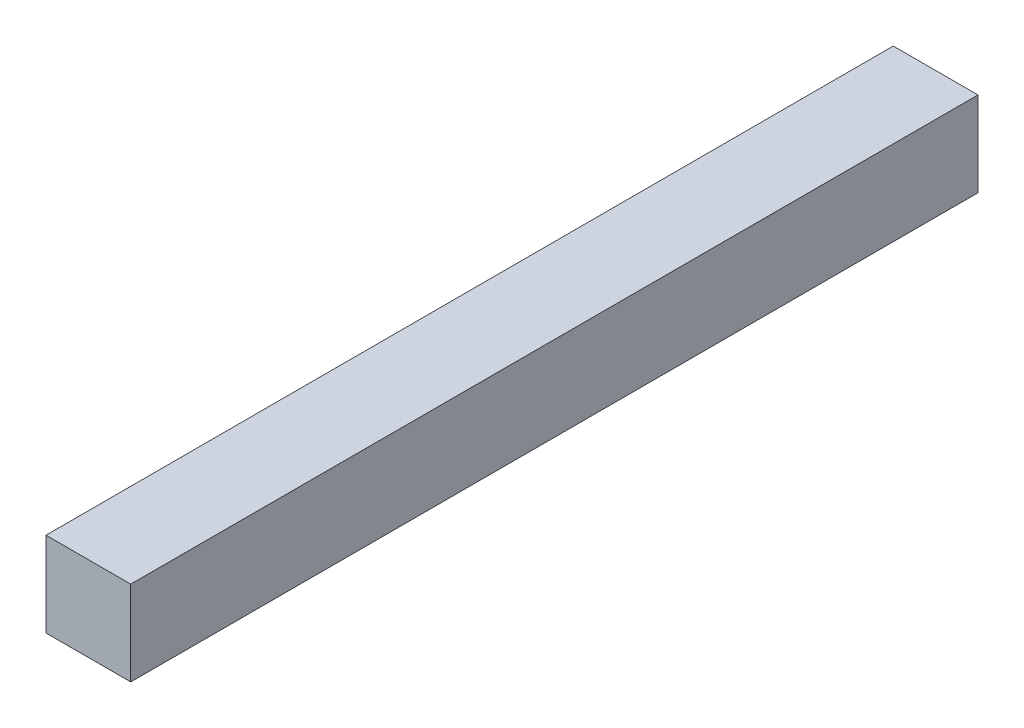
from build123d import *

# Parameters (mm, degrees)
SKETCH1_W      = 25.4
SKETCH1_H      = 25.4
EXTRUDE1_DEPTH = 254


with BuildPart() as part:
    # Sketch1 → Extrude1 (new body)
    with BuildSketch(Plane.XY):
        with Locations((12.7, 12.7)):
            Rectangle(SKETCH1_W, SKETCH1_H)
    extrude(amount=-EXTRUDE1_DEPTH)


solid = part.part
